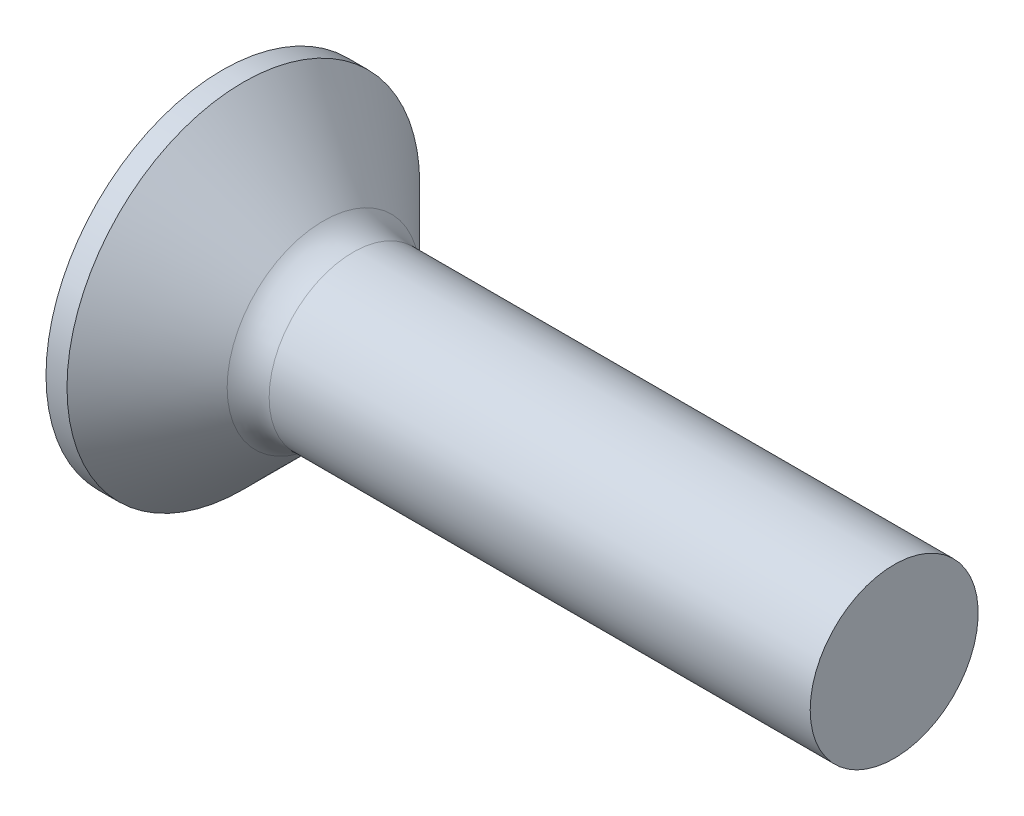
from build123d import *

# Parameters (mm, degrees)
FILLET1_R    = 1
RECPAT_COUNT = 2
RECPAT_ANGLE = 90


with BuildPart() as part:
    # BodySke → Base-Revolve (revolve)
    with BuildSketch(Plane.XY, mode=Mode.PRIVATE) as base_revolve_sk:
        Polygon((0, 0), (0, 4.2), (0.5, 4.2), (2.7, 2), (16, 2), (16, 0), align=None)
    revolve(base_revolve_sk.sketch.rotate(Axis((-6.35, 0, 0), (1, 0, 0)), 90), axis=Axis((-6.35, 0, 0), (1, 0, 0)))

    # Fillet1
    fillet1_edges = [part.edges().sort_by_distance(p)[0] for p in [
        (2.7, 0, -2),
    ]]
    fillet(fillet1_edges, radius=FILLET1_R)

    # Sketch3 → Recess section 0
    with BuildSketch(Plane.ZY):
        with BuildLine():
            Line((-0.515, 2.2), (0.515, 2.2))
            Line((0.515, 2.2), (0.515, -2.2))
            Line((0.515, -2.2), (-0.515, -2.2))
            Line((-0.515, -2.2), (-0.515, 2.2))
        make_face()
    # Sketch4 → Recess section 1
    with BuildSketch(Plane.ZY.offset(-2.51)):
        with BuildLine():
            Line((-0.515, 0.948560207), (0.515, 0.948560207))
            Line((0.515, 0.948560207), (0.515, -0.948560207))
            Line((0.515, -0.948560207), (-0.515, -0.948560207))
            Line((-0.515, -0.948560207), (-0.515, 0.948560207))
        make_face()
    recess = loft(mode=Mode.SUBTRACT)

    # RecPat: Recess ×2 about axis
    recpat_axis = Axis((0, 0, 0), (1, 0, 0))
    for i in range(1, RECPAT_COUNT):
        add(recess.rotate(recpat_axis, i * RECPAT_ANGLE / (RECPAT_COUNT - 1)), mode=Mode.SUBTRACT)

    # RecCorSke → RecessCore (revolve, cut)
    with BuildSketch(Plane.XY, mode=Mode.PRIVATE) as recesscore_sk:
        Polygon((0, 0), (0, 1.026516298), (2.51, 0.851), (2.786506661, 0), align=None)
    revolve(recesscore_sk.sketch.rotate(Axis((-3.175, 0, 0), (1, 0, 0)), 90), axis=Axis((-3.175, 0, 0), (1, 0, 0)), mode=Mode.SUBTRACT)


solid = part.part
